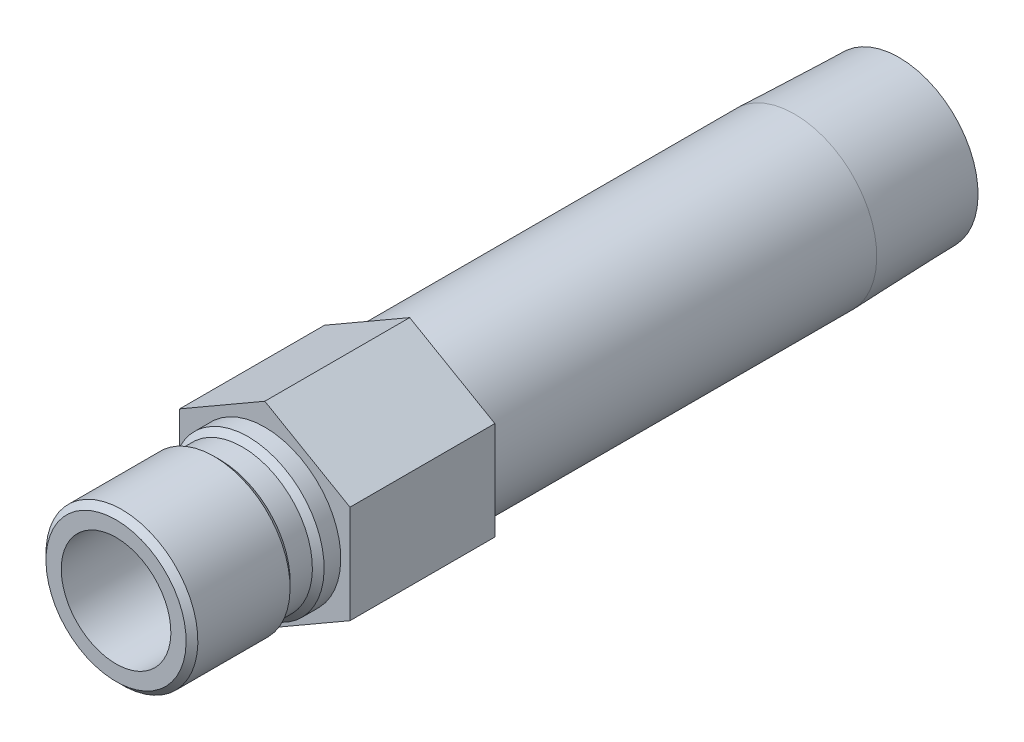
ISO-10303-21;
HEADER;
FILE_DESCRIPTION(('STEP AP214'),'2;1');
FILE_NAME('part.step','',(''),(''),'','','');
FILE_SCHEMA(('AUTOMOTIVE_DESIGN { 1 0 10303 214 1 1 1 1 }'));
ENDSEC;
DATA;
#1=APPLICATION_CONTEXT('core data for automotive mechanical design processes');
#2=APPLICATION_PROTOCOL_DEFINITION('international standard','automotive_design',2000,#1);
#3=PRODUCT_CONTEXT('',#1,'mechanical');
#4=PRODUCT('Part','Part','',(#3));
#5=PRODUCT_RELATED_PRODUCT_CATEGORY('part','',(#4));
#6=PRODUCT_DEFINITION_FORMATION('','',#4);
#7=PRODUCT_DEFINITION_CONTEXT('part definition',#1,'design');
#8=PRODUCT_DEFINITION('design','',#6,#7);
#9=PRODUCT_DEFINITION_SHAPE('','',#8);
#10=(LENGTH_UNIT() NAMED_UNIT(*) SI_UNIT(.MILLI.,.METRE.));
#11=(NAMED_UNIT(*) PLANE_ANGLE_UNIT() SI_UNIT($,.RADIAN.));
#12=(NAMED_UNIT(*) SI_UNIT($,.STERADIAN.) SOLID_ANGLE_UNIT());
#13=UNCERTAINTY_MEASURE_WITH_UNIT(LENGTH_MEASURE(1.E-05),#10,'distance_accuracy_value','');
#14=(GEOMETRIC_REPRESENTATION_CONTEXT(3) GLOBAL_UNCERTAINTY_ASSIGNED_CONTEXT((#13)) GLOBAL_UNIT_ASSIGNED_CONTEXT((#10,
#11,#12)) REPRESENTATION_CONTEXT('',''));
#15=CARTESIAN_POINT('',(0.,0.,0.));
#16=DIRECTION('',(0.,0.,1.));
#17=DIRECTION('',(1.,0.,0.));
#18=AXIS2_PLACEMENT_3D('',#15,#16,#17);
#19=CARTESIAN_POINT('',(0.,0.,0.));
#20=DIRECTION('',(0.,0.,-1.));
#21=DIRECTION('',(0.,1.,0.));
#22=AXIS2_PLACEMENT_3D('',#19,#20,#21);
#23=CYLINDRICAL_SURFACE('',#22,7.112);
#24=CARTESIAN_POINT('',(0.,0.,1.524));
#25=DIRECTION('',(0.,0.,-1.));
#26=DIRECTION('',(0.,1.,0.));
#27=AXIS2_PLACEMENT_3D('',#24,#25,#26);
#28=CIRCLE('',#27,7.112);
#29=CARTESIAN_POINT('',(0.,7.112,1.524));
#30=VERTEX_POINT('',#29);
#31=EDGE_CURVE('E147',#30,#30,#28,.T.);
#32=ORIENTED_EDGE('',*,*,#31,.T.);
#33=EDGE_LOOP('',(#32));
#34=FACE_BOUND('',#33,.T.);
#35=CARTESIAN_POINT('',(0.,0.,19.304));
#36=DIRECTION('',(0.,0.,-1.));
#37=DIRECTION('',(0.,1.,0.));
#38=AXIS2_PLACEMENT_3D('',#35,#36,#37);
#39=CIRCLE('',#38,7.112);
#40=CARTESIAN_POINT('',(0.,7.112,19.304));
#41=VERTEX_POINT('',#40);
#42=EDGE_CURVE('E42',#41,#41,#39,.T.);
#43=ORIENTED_EDGE('',*,*,#42,.F.);
#44=EDGE_LOOP('',(#43));
#45=FACE_BOUND('',#44,.T.);
#46=ADVANCED_FACE('F33',(#34,#45),#23,.F.);
#47=CARTESIAN_POINT('',(0.,7.112,19.304));
#48=DIRECTION('',(0.,0.,1.));
#49=DIRECTION('',(0.,-1.,0.));
#50=AXIS2_PLACEMENT_3D('',#47,#48,#49);
#51=PLANE('',#50);
#52=ORIENTED_EDGE('',*,*,#42,.T.);
#53=EDGE_LOOP('',(#52));
#54=FACE_BOUND('',#53,.T.);
#55=CARTESIAN_POINT('',(0.,0.,19.304));
#56=DIRECTION('',(0.,0.,-1.));
#57=DIRECTION('',(0.,1.,0.));
#58=AXIS2_PLACEMENT_3D('',#55,#56,#57);
#59=CIRCLE('',#58,9.0932);
#60=CARTESIAN_POINT('',(0.,9.0932,19.304));
#61=VERTEX_POINT('',#60);
#62=EDGE_CURVE('E180',#61,#61,#59,.T.);
#63=ORIENTED_EDGE('',*,*,#62,.F.);
#64=EDGE_LOOP('',(#63));
#65=FACE_BOUND('',#64,.T.);
#66=ADVANCED_FACE('F186',(#54,#65),#51,.T.);
#67=CARTESIAN_POINT('',(0.,0.,18.542));
#68=DIRECTION('',(0.,0.,-1.));
#69=DIRECTION('',(0.,1.,0.));
#70=AXIS2_PLACEMENT_3D('',#67,#68,#69);
#71=CONICAL_SURFACE('',#70,9.8552,0.785398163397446);
#72=ORIENTED_EDGE('',*,*,#62,.T.);
#73=EDGE_LOOP('',(#72));
#74=FACE_BOUND('',#73,.T.);
#75=CARTESIAN_POINT('',(0.,0.,18.542));
#76=DIRECTION('',(0.,0.,-1.));
#77=DIRECTION('',(0.,1.,0.));
#78=AXIS2_PLACEMENT_3D('',#75,#76,#77);
#79=CIRCLE('',#78,9.8552);
#80=CARTESIAN_POINT('',(0.,9.8552,18.542));
#81=VERTEX_POINT('',#80);
#82=EDGE_CURVE('E177',#81,#81,#79,.T.);
#83=ORIENTED_EDGE('',*,*,#82,.F.);
#84=EDGE_LOOP('',(#83));
#85=FACE_BOUND('',#84,.T.);
#86=ADVANCED_FACE('F194',(#74,#85),#71,.T.);
#87=CARTESIAN_POINT('',(0.,0.,0.));
#88=DIRECTION('',(0.,0.,-1.));
#89=DIRECTION('',(0.,1.,0.));
#90=AXIS2_PLACEMENT_3D('',#87,#88,#89);
#91=CYLINDRICAL_SURFACE('',#90,9.8552);
#92=ORIENTED_EDGE('',*,*,#82,.T.);
#93=EDGE_LOOP('',(#92));
#94=FACE_BOUND('',#93,.T.);
#95=CARTESIAN_POINT('',(0.,0.,6.5786));
#96=DIRECTION('',(0.,0.,-1.));
#97=DIRECTION('',(0.,1.,0.));
#98=AXIS2_PLACEMENT_3D('',#95,#96,#97);
#99=CIRCLE('',#98,9.8552);
#100=CARTESIAN_POINT('',(0.,9.8552,6.5786));
#101=VERTEX_POINT('',#100);
#102=EDGE_CURVE('E174',#101,#101,#99,.T.);
#103=ORIENTED_EDGE('',*,*,#102,.F.);
#104=EDGE_LOOP('',(#103));
#105=FACE_BOUND('',#104,.T.);
#106=ADVANCED_FACE('F249',(#94,#105),#91,.T.);
#107=CARTESIAN_POINT('',(0.,0.,5.8166));
#108=DIRECTION('',(0.,0.,1.));
#109=DIRECTION('',(0.,-1.,0.));
#110=AXIS2_PLACEMENT_3D('',#107,#108,#109);
#111=CONICAL_SURFACE('',#110,9.0932,0.785398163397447);
#112=ORIENTED_EDGE('',*,*,#102,.T.);
#113=EDGE_LOOP('',(#112));
#114=FACE_BOUND('',#113,.T.);
#115=CARTESIAN_POINT('',(0.,0.,5.8166));
#116=DIRECTION('',(0.,0.,-1.));
#117=DIRECTION('',(0.,1.,0.));
#118=AXIS2_PLACEMENT_3D('',#115,#116,#117);
#119=CIRCLE('',#118,9.0932);
#120=CARTESIAN_POINT('',(0.,9.0932,5.8166));
#121=VERTEX_POINT('',#120);
#122=EDGE_CURVE('E171',#121,#121,#119,.T.);
#123=ORIENTED_EDGE('',*,*,#122,.F.);
#124=EDGE_LOOP('',(#123));
#125=FACE_BOUND('',#124,.T.);
#126=ADVANCED_FACE('F245',(#114,#125),#111,.T.);
#127=CARTESIAN_POINT('',(0.,0.,0.));
#128=DIRECTION('',(0.,0.,-1.));
#129=DIRECTION('',(0.,1.,0.));
#130=AXIS2_PLACEMENT_3D('',#127,#128,#129);
#131=CYLINDRICAL_SURFACE('',#130,9.0932);
#132=ORIENTED_EDGE('',*,*,#122,.T.);
#133=EDGE_LOOP('',(#132));
#134=FACE_BOUND('',#133,.T.);
#135=CARTESIAN_POINT('',(0.,0.,2.921));
#136=DIRECTION('',(0.,0.,-1.));
#137=DIRECTION('',(0.,1.,0.));
#138=AXIS2_PLACEMENT_3D('',#135,#136,#137);
#139=CIRCLE('',#138,9.0932);
#140=CARTESIAN_POINT('',(0.,9.0932,2.921));
#141=VERTEX_POINT('',#140);
#142=EDGE_CURVE('E168',#141,#141,#139,.T.);
#143=ORIENTED_EDGE('',*,*,#142,.F.);
#144=EDGE_LOOP('',(#143));
#145=FACE_BOUND('',#144,.T.);
#146=ADVANCED_FACE('F241',(#134,#145),#131,.T.);
#147=CARTESIAN_POINT('',(0.,0.,2.159));
#148=DIRECTION('',(0.,0.,-1.));
#149=DIRECTION('',(0.,1.,0.));
#150=AXIS2_PLACEMENT_3D('',#147,#148,#149);
#151=CONICAL_SURFACE('',#150,9.8552,0.785398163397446);
#152=ORIENTED_EDGE('',*,*,#142,.T.);
#153=EDGE_LOOP('',(#152));
#154=FACE_BOUND('',#153,.T.);
#155=CARTESIAN_POINT('',(0.,0.,2.159));
#156=DIRECTION('',(0.,0.,-1.));
#157=DIRECTION('',(0.,1.,0.));
#158=AXIS2_PLACEMENT_3D('',#155,#156,#157);
#159=CIRCLE('',#158,9.8552);
#160=CARTESIAN_POINT('',(0.,9.8552,2.159));
#161=VERTEX_POINT('',#160);
#162=EDGE_CURVE('E165',#161,#161,#159,.T.);
#163=ORIENTED_EDGE('',*,*,#162,.F.);
#164=EDGE_LOOP('',(#163));
#165=FACE_BOUND('',#164,.T.);
#166=ADVANCED_FACE('F237',(#154,#165),#151,.T.);
#167=CARTESIAN_POINT('',(0.,0.,0.));
#168=DIRECTION('',(0.,0.,-1.));
#169=DIRECTION('',(0.,1.,0.));
#170=AXIS2_PLACEMENT_3D('',#167,#168,#169);
#171=CYLINDRICAL_SURFACE('',#170,9.8552);
#172=ORIENTED_EDGE('',*,*,#162,.T.);
#173=EDGE_LOOP('',(#172));
#174=FACE_BOUND('',#173,.T.);
#175=CARTESIAN_POINT('',(0.,0.,0.));
#176=DIRECTION('',(0.,0.,-1.));
#177=DIRECTION('',(0.,1.,0.));
#178=AXIS2_PLACEMENT_3D('',#175,#176,#177);
#179=CIRCLE('',#178,9.8552);
#180=CARTESIAN_POINT('',(0.,9.8552,0.));
#181=VERTEX_POINT('',#180);
#182=EDGE_CURVE('E162',#181,#181,#179,.T.);
#183=ORIENTED_EDGE('',*,*,#182,.F.);
#184=EDGE_LOOP('',(#183));
#185=FACE_BOUND('',#184,.T.);
#186=ADVANCED_FACE('F233',(#174,#185),#171,.T.);
#187=CARTESIAN_POINT('',(0.,9.8552,0.));
#188=DIRECTION('',(0.,0.,1.));
#189=DIRECTION('',(0.,-1.,0.));
#190=AXIS2_PLACEMENT_3D('',#187,#188,#189);
#191=PLANE('',#190);
#192=ORIENTED_EDGE('',*,*,#182,.T.);
#193=EDGE_LOOP('',(#192));
#194=FACE_BOUND('',#193,.T.);
#195=DIRECTION('',(-0.866025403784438,-0.5,0.));
#196=VECTOR('',#195,1.);
#197=CARTESIAN_POINT('',(0.,12.7582862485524,0.));
#198=LINE('',#197,#196);
#199=CARTESIAN_POINT('',(0.,12.7582862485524,0.));
#200=VERTEX_POINT('',#199);
#201=CARTESIAN_POINT('',(-11.049,6.37914312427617,0.));
#202=VERTEX_POINT('',#201);
#203=EDGE_CURVE('E121',#200,#202,#198,.T.);
#204=ORIENTED_EDGE('',*,*,#203,.T.);
#205=DIRECTION('',(0.,-1.,0.));
#206=VECTOR('',#205,1.);
#207=CARTESIAN_POINT('',(-11.049,6.37914312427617,0.));
#208=LINE('',#207,#206);
#209=CARTESIAN_POINT('',(-11.049,-6.37914312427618,0.));
#210=VERTEX_POINT('',#209);
#211=EDGE_CURVE('E124',#202,#210,#208,.T.);
#212=ORIENTED_EDGE('',*,*,#211,.T.);
#213=DIRECTION('',(0.866025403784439,-0.5,0.));
#214=VECTOR('',#213,1.);
#215=CARTESIAN_POINT('',(-11.049,-6.37914312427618,0.));
#216=LINE('',#215,#214);
#217=CARTESIAN_POINT('',(0.,-12.7582862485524,0.));
#218=VERTEX_POINT('',#217);
#219=EDGE_CURVE('E128',#210,#218,#216,.T.);
#220=ORIENTED_EDGE('',*,*,#219,.T.);
#221=DIRECTION('',(0.866025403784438,0.5,0.));
#222=VECTOR('',#221,1.);
#223=CARTESIAN_POINT('',(0.,-12.7582862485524,0.));
#224=LINE('',#223,#222);
#225=CARTESIAN_POINT('',(11.049,-6.37914312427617,0.));
#226=VERTEX_POINT('',#225);
#227=EDGE_CURVE('E131',#218,#226,#224,.T.);
#228=ORIENTED_EDGE('',*,*,#227,.T.);
#229=DIRECTION('',(0.,1.,0.));
#230=VECTOR('',#229,1.);
#231=CARTESIAN_POINT('',(11.049,-6.37914312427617,0.));
#232=LINE('',#231,#230);
#233=CARTESIAN_POINT('',(11.049,6.37914312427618,0.));
#234=VERTEX_POINT('',#233);
#235=EDGE_CURVE('E98',#226,#234,#232,.T.);
#236=ORIENTED_EDGE('',*,*,#235,.T.);
#237=DIRECTION('',(-0.866025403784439,0.5,0.));
#238=VECTOR('',#237,1.);
#239=CARTESIAN_POINT('',(11.049,6.37914312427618,0.));
#240=LINE('',#239,#238);
#241=EDGE_CURVE('E134',#234,#200,#240,.T.);
#242=ORIENTED_EDGE('',*,*,#241,.T.);
#243=EDGE_LOOP('',(#204,#212,#220,#228,#236,#242));
#244=FACE_BOUND('',#243,.T.);
#245=ADVANCED_FACE('F210',(#194,#244),#191,.T.);
#246=CARTESIAN_POINT('',(0.,0.,0.));
#247=DIRECTION('',(0.,0.,-1.));
#248=DIRECTION('',(0.,1.,0.));
#249=AXIS2_PLACEMENT_3D('',#246,#247,#248);
#250=CYLINDRICAL_SURFACE('',#249,7.89939999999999);
#251=CARTESIAN_POINT('',(0.,0.,0.));
#252=DIRECTION('',(0.,0.,1.));
#253=DIRECTION('',(1.,0.,0.));
#254=AXIS2_PLACEMENT_3D('',#251,#252,#253);
#255=CIRCLE('',#254,7.89939999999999);
#256=CARTESIAN_POINT('',(7.89939999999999,0.,0.));
#257=VERTEX_POINT('',#256);
#258=EDGE_CURVE('E11',#257,#257,#255,.T.);
#259=ORIENTED_EDGE('',*,*,#258,.F.);
#260=EDGE_LOOP('',(#259));
#261=FACE_BOUND('',#260,.T.);
#262=CARTESIAN_POINT('',(0.,0.,1.10533199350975));
#263=DIRECTION('',(0.,0.,-1.));
#264=DIRECTION('',(0.,1.,0.));
#265=AXIS2_PLACEMENT_3D('',#262,#263,#264);
#266=CIRCLE('',#265,7.8994);
#267=CARTESIAN_POINT('',(0.,7.8994,1.10533199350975));
#268=VERTEX_POINT('',#267);
#269=EDGE_CURVE('E150',#268,#268,#266,.T.);
#270=ORIENTED_EDGE('',*,*,#269,.F.);
#271=EDGE_LOOP('',(#270));
#272=FACE_BOUND('',#271,.T.);
#273=ADVANCED_FACE('F200',(#261,#272),#250,.F.);
#274=CARTESIAN_POINT('',(0.,0.,1.524));
#275=DIRECTION('',(0.,0.,-1.));
#276=DIRECTION('',(0.,1.,0.));
#277=AXIS2_PLACEMENT_3D('',#274,#275,#276);
#278=CONICAL_SURFACE('',#277,7.112,1.08210413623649);
#279=ORIENTED_EDGE('',*,*,#269,.T.);
#280=EDGE_LOOP('',(#279));
#281=FACE_BOUND('',#280,.T.);
#282=ORIENTED_EDGE('',*,*,#31,.F.);
#283=EDGE_LOOP('',(#282));
#284=FACE_BOUND('',#283,.T.);
#285=ADVANCED_FACE('F197',(#281,#284),#278,.F.);
#286=CARTESIAN_POINT('',(-11.049,6.37914312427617,-18.796));
#287=DIRECTION('',(0.,0.,1.));
#288=DIRECTION('',(1.,0.,0.));
#289=AXIS2_PLACEMENT_3D('',#286,#287,#288);
#290=PLANE('',#289);
#291=CARTESIAN_POINT('',(0.,0.,-18.796));
#292=DIRECTION('',(0.,0.,1.));
#293=DIRECTION('',(1.,0.,0.));
#294=AXIS2_PLACEMENT_3D('',#291,#292,#293);
#295=CIRCLE('',#294,7.89939999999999);
#296=CARTESIAN_POINT('',(7.89939999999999,0.,-18.796));
#297=VERTEX_POINT('',#296);
#298=EDGE_CURVE('E36',#297,#297,#295,.T.);
#299=ORIENTED_EDGE('',*,*,#298,.F.);
#300=EDGE_LOOP('',(#299));
#301=FACE_BOUND('',#300,.T.);
#302=CARTESIAN_POINT('',(0.,0.,-18.796));
#303=DIRECTION('',(0.,0.,1.));
#304=DIRECTION('',(1.,0.,0.));
#305=AXIS2_PLACEMENT_3D('',#302,#303,#304);
#306=CIRCLE('',#305,7.112);
#307=CARTESIAN_POINT('',(7.112,0.,-18.796));
#308=VERTEX_POINT('',#307);
#309=EDGE_CURVE('E125',#308,#308,#306,.T.);
#310=ORIENTED_EDGE('',*,*,#309,.T.);
#311=EDGE_LOOP('',(#310));
#312=FACE_BOUND('',#311,.T.);
#313=ADVANCED_FACE('F199',(#301,#312),#290,.F.);
#314=CARTESIAN_POINT('',(0.,0.,-18.796));
#315=DIRECTION('',(0.,0.,1.));
#316=DIRECTION('',(1.,0.,0.));
#317=AXIS2_PLACEMENT_3D('',#314,#315,#316);
#318=CYLINDRICAL_SURFACE('',#317,7.112);
#319=ORIENTED_EDGE('',*,*,#309,.F.);
#320=EDGE_LOOP('',(#319));
#321=FACE_BOUND('',#320,.T.);
#322=CARTESIAN_POINT('',(0.,0.,0.));
#323=DIRECTION('',(0.,0.,1.));
#324=DIRECTION('',(1.,0.,0.));
#325=AXIS2_PLACEMENT_3D('',#322,#323,#324);
#326=CIRCLE('',#325,7.112);
#327=CARTESIAN_POINT('',(7.112,0.,0.));
#328=VERTEX_POINT('',#327);
#329=EDGE_CURVE('E443',#328,#328,#326,.T.);
#330=ORIENTED_EDGE('',*,*,#329,.T.);
#331=EDGE_LOOP('',(#330));
#332=FACE_BOUND('',#331,.T.);
#333=ADVANCED_FACE('F207',(#321,#332),#318,.F.);
#334=CARTESIAN_POINT('',(-11.049,6.37914312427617,0.));
#335=DIRECTION('',(0.,0.,1.));
#336=DIRECTION('',(1.,0.,0.));
#337=AXIS2_PLACEMENT_3D('',#334,#335,#336);
#338=PLANE('',#337);
#339=ORIENTED_EDGE('',*,*,#258,.T.);
#340=EDGE_LOOP('',(#339));
#341=FACE_BOUND('',#340,.T.);
#342=ORIENTED_EDGE('',*,*,#329,.F.);
#343=EDGE_LOOP('',(#342));
#344=FACE_BOUND('',#343,.T.);
#345=ADVANCED_FACE('F221',(#341,#344),#338,.T.);
#346=CARTESIAN_POINT('',(0.,10.244140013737,-82.296));
#347=DIRECTION('',(0.,0.,-1.));
#348=DIRECTION('',(0.,1.,0.));
#349=AXIS2_PLACEMENT_3D('',#346,#347,#348);
#350=PLANE('',#349);
#351=CARTESIAN_POINT('',(0.,0.,-82.296));
#352=DIRECTION('',(0.,0.,-1.));
#353=DIRECTION('',(0.,1.,0.));
#354=AXIS2_PLACEMENT_3D('',#351,#352,#353);
#355=CIRCLE('',#354,10.244140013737);
#356=CARTESIAN_POINT('',(0.,10.244140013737,-82.296));
#357=VERTEX_POINT('',#356);
#358=EDGE_CURVE('E156',#357,#357,#355,.T.);
#359=ORIENTED_EDGE('',*,*,#358,.T.);
#360=EDGE_LOOP('',(#359));
#361=FACE_BOUND('',#360,.T.);
#362=CARTESIAN_POINT('',(0.,0.,-82.296));
#363=DIRECTION('',(0.,0.,-1.));
#364=DIRECTION('',(0.,1.,0.));
#365=AXIS2_PLACEMENT_3D('',#362,#363,#364);
#366=CIRCLE('',#365,7.89939999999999);
#367=CARTESIAN_POINT('',(0.,7.8994,-82.296));
#368=VERTEX_POINT('',#367);
#369=EDGE_CURVE('E153',#368,#368,#366,.T.);
#370=ORIENTED_EDGE('',*,*,#369,.F.);
#371=EDGE_LOOP('',(#370));
#372=FACE_BOUND('',#371,.T.);
#373=ADVANCED_FACE('F218',(#361,#372),#350,.T.);
#374=ORIENTED_EDGE('',*,*,#369,.T.);
#375=EDGE_LOOP('',(#374));
#376=FACE_BOUND('',#375,.T.);
#377=ORIENTED_EDGE('',*,*,#298,.T.);
#378=EDGE_LOOP('',(#377));
#379=FACE_BOUND('',#378,.T.);
#380=ADVANCED_FACE('F213',(#376,#379),#250,.F.);
#381=CARTESIAN_POINT('',(0.,0.,-82.296));
#382=DIRECTION('',(0.,0.,1.));
#383=DIRECTION('',(0.,-1.,0.));
#384=AXIS2_PLACEMENT_3D('',#381,#382,#383);
#385=CONICAL_SURFACE('',#384,10.244140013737,0.0312396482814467);
#386=CARTESIAN_POINT('',(0.,0.,-68.7324));
#387=DIRECTION('',(0.,0.,-1.));
#388=DIRECTION('',(0.,1.,0.));
#389=AXIS2_PLACEMENT_3D('',#386,#387,#388);
#390=CIRCLE('',#389,10.668);
#391=CARTESIAN_POINT('',(0.,10.668,-68.7324));
#392=VERTEX_POINT('',#391);
#393=EDGE_CURVE('E159',#392,#392,#390,.T.);
#394=ORIENTED_EDGE('',*,*,#393,.T.);
#395=EDGE_LOOP('',(#394));
#396=FACE_BOUND('',#395,.T.);
#397=ORIENTED_EDGE('',*,*,#358,.F.);
#398=EDGE_LOOP('',(#397));
#399=FACE_BOUND('',#398,.T.);
#400=ADVANCED_FACE('F223',(#396,#399),#385,.T.);
#401=CARTESIAN_POINT('',(0.,0.,0.));
#402=DIRECTION('',(0.,0.,-1.));
#403=DIRECTION('',(0.,1.,0.));
#404=AXIS2_PLACEMENT_3D('',#401,#402,#403);
#405=CYLINDRICAL_SURFACE('',#404,10.668);
#406=ORIENTED_EDGE('',*,*,#393,.F.);
#407=EDGE_LOOP('',(#406));
#408=FACE_BOUND('',#407,.T.);
#409=CARTESIAN_POINT('',(0.,0.,-18.796));
#410=DIRECTION('',(0.,0.,1.));
#411=DIRECTION('',(1.,0.,0.));
#412=AXIS2_PLACEMENT_3D('',#409,#410,#411);
#413=CIRCLE('',#412,10.668);
#414=CARTESIAN_POINT('',(10.668,0.,-18.796));
#415=VERTEX_POINT('',#414);
#416=EDGE_CURVE('E144',#415,#415,#413,.F.);
#417=ORIENTED_EDGE('',*,*,#416,.T.);
#418=EDGE_LOOP('',(#417));
#419=FACE_BOUND('',#418,.T.);
#420=ADVANCED_FACE('F226',(#408,#419),#405,.T.);
#421=ORIENTED_EDGE('',*,*,#416,.F.);
#422=EDGE_LOOP('',(#421));
#423=FACE_BOUND('',#422,.T.);
#424=DIRECTION('',(-0.866025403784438,-0.5,0.));
#425=VECTOR('',#424,1.);
#426=CARTESIAN_POINT('',(0.,12.7582862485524,-18.796));
#427=LINE('',#426,#425);
#428=CARTESIAN_POINT('',(0.,12.7582862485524,-18.796));
#429=VERTEX_POINT('',#428);
#430=CARTESIAN_POINT('',(-11.049,6.37914312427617,-18.796));
#431=VERTEX_POINT('',#430);
#432=EDGE_CURVE('E137',#429,#431,#427,.T.);
#433=ORIENTED_EDGE('',*,*,#432,.F.);
#434=DIRECTION('',(-0.866025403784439,0.5,0.));
#435=VECTOR('',#434,1.);
#436=CARTESIAN_POINT('',(11.049,6.37914312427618,-18.796));
#437=LINE('',#436,#435);
#438=CARTESIAN_POINT('',(11.049,6.37914312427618,-18.796));
#439=VERTEX_POINT('',#438);
#440=EDGE_CURVE('E111',#439,#429,#437,.T.);
#441=ORIENTED_EDGE('',*,*,#440,.F.);
#442=DIRECTION('',(0.,1.,0.));
#443=VECTOR('',#442,1.);
#444=CARTESIAN_POINT('',(11.049,-6.37914312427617,-18.796));
#445=LINE('',#444,#443);
#446=CARTESIAN_POINT('',(11.049,-6.37914312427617,-18.796));
#447=VERTEX_POINT('',#446);
#448=EDGE_CURVE('E96',#447,#439,#445,.T.);
#449=ORIENTED_EDGE('',*,*,#448,.F.);
#450=DIRECTION('',(0.866025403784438,0.5,0.));
#451=VECTOR('',#450,1.);
#452=CARTESIAN_POINT('',(0.,-12.7582862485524,-18.796));
#453=LINE('',#452,#451);
#454=CARTESIAN_POINT('',(0.,-12.7582862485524,-18.796));
#455=VERTEX_POINT('',#454);
#456=EDGE_CURVE('E109',#455,#447,#453,.T.);
#457=ORIENTED_EDGE('',*,*,#456,.F.);
#458=DIRECTION('',(0.866025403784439,-0.5,0.));
#459=VECTOR('',#458,1.);
#460=CARTESIAN_POINT('',(-11.049,-6.37914312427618,-18.796));
#461=LINE('',#460,#459);
#462=CARTESIAN_POINT('',(-11.049,-6.37914312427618,-18.796));
#463=VERTEX_POINT('',#462);
#464=EDGE_CURVE('E114',#463,#455,#461,.T.);
#465=ORIENTED_EDGE('',*,*,#464,.F.);
#466=DIRECTION('',(0.,-1.,0.));
#467=VECTOR('',#466,1.);
#468=CARTESIAN_POINT('',(-11.049,6.37914312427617,-18.796));
#469=LINE('',#468,#467);
#470=EDGE_CURVE('E116',#431,#463,#469,.T.);
#471=ORIENTED_EDGE('',*,*,#470,.F.);
#472=EDGE_LOOP('',(#433,#441,#449,#457,#465,#471));
#473=FACE_BOUND('',#472,.T.);
#474=ADVANCED_FACE('F107',(#423,#473),#290,.F.);
#475=CARTESIAN_POINT('',(0.,12.7582862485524,-18.796));
#476=DIRECTION('',(-0.5,0.866025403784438,0.));
#477=DIRECTION('',(-0.866025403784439,-0.5,0.));
#478=AXIS2_PLACEMENT_3D('',#475,#476,#477);
#479=PLANE('',#478);
#480=ORIENTED_EDGE('',*,*,#203,.F.);
#481=DIRECTION('',(0.,0.,1.));
#482=VECTOR('',#481,1.);
#483=CARTESIAN_POINT('',(0.,12.7582862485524,-18.796));
#484=LINE('',#483,#482);
#485=EDGE_CURVE('E50',#429,#200,#484,.T.);
#486=ORIENTED_EDGE('',*,*,#485,.F.);
#487=ORIENTED_EDGE('',*,*,#432,.T.);
#488=DIRECTION('',(0.,0.,1.));
#489=VECTOR('',#488,1.);
#490=CARTESIAN_POINT('',(-11.049,6.37914312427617,-18.796));
#491=LINE('',#490,#489);
#492=EDGE_CURVE('E85',#431,#202,#491,.T.);
#493=ORIENTED_EDGE('',*,*,#492,.T.);
#494=EDGE_LOOP('',(#480,#486,#487,#493));
#495=FACE_BOUND('',#494,.T.);
#496=ADVANCED_FACE('F215',(#495),#479,.T.);
#497=CARTESIAN_POINT('',(11.049,6.37914312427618,-18.796));
#498=DIRECTION('',(0.5,0.866025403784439,0.));
#499=DIRECTION('',(-0.866025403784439,0.5,0.));
#500=AXIS2_PLACEMENT_3D('',#497,#498,#499);
#501=PLANE('',#500);
#502=ORIENTED_EDGE('',*,*,#241,.F.);
#503=DIRECTION('',(0.,0.,1.));
#504=VECTOR('',#503,1.);
#505=CARTESIAN_POINT('',(11.049,6.37914312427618,-18.796));
#506=LINE('',#505,#504);
#507=EDGE_CURVE('E73',#439,#234,#506,.T.);
#508=ORIENTED_EDGE('',*,*,#507,.F.);
#509=ORIENTED_EDGE('',*,*,#440,.T.);
#510=ORIENTED_EDGE('',*,*,#485,.T.);
#511=EDGE_LOOP('',(#502,#508,#509,#510));
#512=FACE_BOUND('',#511,.T.);
#513=ADVANCED_FACE('F276',(#512),#501,.T.);
#514=CARTESIAN_POINT('',(11.049,-6.37914312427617,-18.796));
#515=DIRECTION('',(1.,0.,0.));
#516=DIRECTION('',(0.,1.,0.));
#517=AXIS2_PLACEMENT_3D('',#514,#515,#516);
#518=PLANE('',#517);
#519=ORIENTED_EDGE('',*,*,#235,.F.);
#520=DIRECTION('',(0.,0.,1.));
#521=VECTOR('',#520,1.);
#522=CARTESIAN_POINT('',(11.049,-6.37914312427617,-18.796));
#523=LINE('',#522,#521);
#524=EDGE_CURVE('E93',#447,#226,#523,.T.);
#525=ORIENTED_EDGE('',*,*,#524,.F.);
#526=ORIENTED_EDGE('',*,*,#448,.T.);
#527=ORIENTED_EDGE('',*,*,#507,.T.);
#528=EDGE_LOOP('',(#519,#525,#526,#527));
#529=FACE_BOUND('',#528,.T.);
#530=ADVANCED_FACE('F95',(#529),#518,.T.);
#531=CARTESIAN_POINT('',(0.,-12.7582862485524,-18.796));
#532=DIRECTION('',(0.5,-0.866025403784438,0.));
#533=DIRECTION('',(0.866025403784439,0.5,0.));
#534=AXIS2_PLACEMENT_3D('',#531,#532,#533);
#535=PLANE('',#534);
#536=ORIENTED_EDGE('',*,*,#227,.F.);
#537=DIRECTION('',(0.,0.,1.));
#538=VECTOR('',#537,1.);
#539=CARTESIAN_POINT('',(0.,-12.7582862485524,-18.796));
#540=LINE('',#539,#538);
#541=EDGE_CURVE('E103',#455,#218,#540,.T.);
#542=ORIENTED_EDGE('',*,*,#541,.F.);
#543=ORIENTED_EDGE('',*,*,#456,.T.);
#544=ORIENTED_EDGE('',*,*,#524,.T.);
#545=EDGE_LOOP('',(#536,#542,#543,#544));
#546=FACE_BOUND('',#545,.T.);
#547=ADVANCED_FACE('F113',(#546),#535,.T.);
#548=CARTESIAN_POINT('',(-11.049,-6.37914312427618,-18.796));
#549=DIRECTION('',(-0.5,-0.866025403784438,0.));
#550=DIRECTION('',(0.866025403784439,-0.5,0.));
#551=AXIS2_PLACEMENT_3D('',#548,#549,#550);
#552=PLANE('',#551);
#553=ORIENTED_EDGE('',*,*,#219,.F.);
#554=DIRECTION('',(0.,0.,1.));
#555=VECTOR('',#554,1.);
#556=CARTESIAN_POINT('',(-11.049,-6.37914312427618,-18.796));
#557=LINE('',#556,#555);
#558=EDGE_CURVE('E141',#463,#210,#557,.T.);
#559=ORIENTED_EDGE('',*,*,#558,.F.);
#560=ORIENTED_EDGE('',*,*,#464,.T.);
#561=ORIENTED_EDGE('',*,*,#541,.T.);
#562=EDGE_LOOP('',(#553,#559,#560,#561));
#563=FACE_BOUND('',#562,.T.);
#564=ADVANCED_FACE('F275',(#563),#552,.T.);
#565=CARTESIAN_POINT('',(-11.049,6.37914312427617,-18.796));
#566=DIRECTION('',(-1.,0.,0.));
#567=DIRECTION('',(0.,0.,1.));
#568=AXIS2_PLACEMENT_3D('',#565,#566,#567);
#569=PLANE('',#568);
#570=ORIENTED_EDGE('',*,*,#211,.F.);
#571=ORIENTED_EDGE('',*,*,#492,.F.);
#572=ORIENTED_EDGE('',*,*,#470,.T.);
#573=ORIENTED_EDGE('',*,*,#558,.T.);
#574=EDGE_LOOP('',(#570,#571,#572,#573));
#575=FACE_BOUND('',#574,.T.);
#576=ADVANCED_FACE('F272',(#575),#569,.T.);
#577=CLOSED_SHELL('',(#46,#66,#86,#106,#126,#146,#166,#186,#245,#273,#285,#313,#333,#345,#373,
#380,#400,#420,#474,#496,#513,#530,#547,#564,#576));
#578=MANIFOLD_SOLID_BREP('B2',#577);
#579=ADVANCED_BREP_SHAPE_REPRESENTATION('',(#18,#578),#14);
#580=SHAPE_DEFINITION_REPRESENTATION(#9,#579);
ENDSEC;
END-ISO-10303-21;
